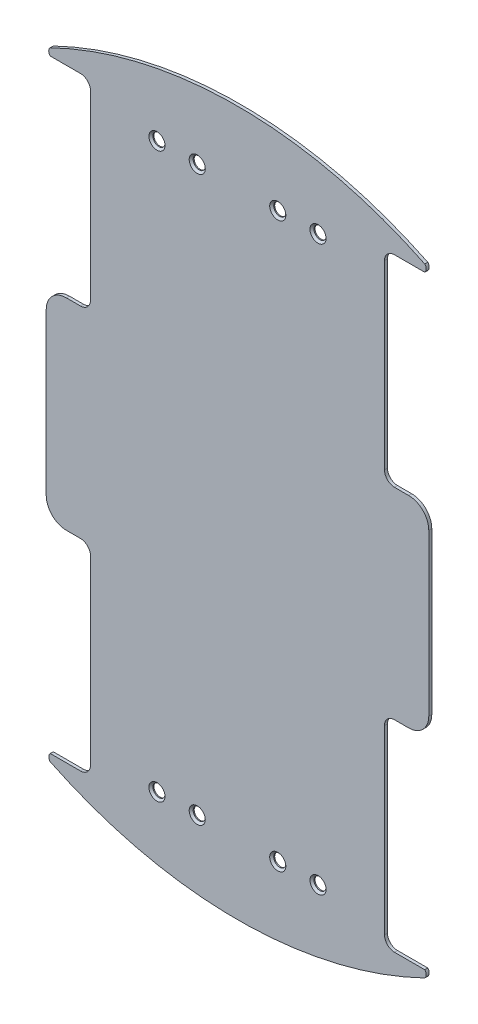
ISO-10303-21;
HEADER;
FILE_DESCRIPTION(('STEP AP214'),'2;1');
FILE_NAME('part.step','',(''),(''),'','','');
FILE_SCHEMA(('AUTOMOTIVE_DESIGN { 1 0 10303 214 1 1 1 1 }'));
ENDSEC;
DATA;
#1=APPLICATION_CONTEXT('core data for automotive mechanical design processes');
#2=APPLICATION_PROTOCOL_DEFINITION('international standard','automotive_design',2000,#1);
#3=PRODUCT_CONTEXT('',#1,'mechanical');
#4=PRODUCT('Part','Part','',(#3));
#5=PRODUCT_RELATED_PRODUCT_CATEGORY('part','',(#4));
#6=PRODUCT_DEFINITION_FORMATION('','',#4);
#7=PRODUCT_DEFINITION_CONTEXT('part definition',#1,'design');
#8=PRODUCT_DEFINITION('design','',#6,#7);
#9=PRODUCT_DEFINITION_SHAPE('','',#8);
#10=(LENGTH_UNIT() NAMED_UNIT(*) SI_UNIT(.MILLI.,.METRE.));
#11=(NAMED_UNIT(*) PLANE_ANGLE_UNIT() SI_UNIT($,.RADIAN.));
#12=(NAMED_UNIT(*) SI_UNIT($,.STERADIAN.) SOLID_ANGLE_UNIT());
#13=UNCERTAINTY_MEASURE_WITH_UNIT(LENGTH_MEASURE(1.E-05),#10,'distance_accuracy_value','');
#14=(GEOMETRIC_REPRESENTATION_CONTEXT(3) GLOBAL_UNCERTAINTY_ASSIGNED_CONTEXT((#13)) GLOBAL_UNIT_ASSIGNED_CONTEXT((#10,
#11,#12)) REPRESENTATION_CONTEXT('',''));
#15=CARTESIAN_POINT('',(0.,0.,0.));
#16=DIRECTION('',(0.,0.,1.));
#17=DIRECTION('',(1.,0.,0.));
#18=AXIS2_PLACEMENT_3D('',#15,#16,#17);
#19=CARTESIAN_POINT('',(113.,10.,1.5));
#20=DIRECTION('',(0.,0.,1.));
#21=DIRECTION('',(1.,0.,0.));
#22=AXIS2_PLACEMENT_3D('',#19,#20,#21);
#23=CONICAL_SURFACE('',#22,4.00000000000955,0.785398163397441);
#24=CARTESIAN_POINT('',(113.,10.,0.499999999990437));
#25=DIRECTION('',(0.,0.,1.));
#26=DIRECTION('',(1.,0.,0.));
#27=AXIS2_PLACEMENT_3D('',#24,#25,#26);
#28=CIRCLE('',#27,3.);
#29=CARTESIAN_POINT('',(116.,10.,0.499999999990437));
#30=VERTEX_POINT('',#29);
#31=EDGE_CURVE('E43',#30,#30,#28,.T.);
#32=ORIENTED_EDGE('',*,*,#31,.F.);
#33=EDGE_LOOP('',(#32));
#34=FACE_BOUND('',#33,.T.);
#35=CARTESIAN_POINT('',(113.,10.,1.5));
#36=DIRECTION('',(0.,0.,1.));
#37=DIRECTION('',(1.,0.,0.));
#38=AXIS2_PLACEMENT_3D('',#35,#36,#37);
#39=CIRCLE('',#38,4.00000000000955);
#40=CARTESIAN_POINT('',(117.000000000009,10.,1.5));
#41=VERTEX_POINT('',#40);
#42=EDGE_CURVE('E11',#41,#41,#39,.T.);
#43=ORIENTED_EDGE('',*,*,#42,.T.);
#44=EDGE_LOOP('',(#43));
#45=FACE_BOUND('',#44,.T.);
#46=ADVANCED_FACE('F36',(#34,#45),#23,.F.);
#47=CARTESIAN_POINT('',(113.,10.,1.5));
#48=DIRECTION('',(0.,0.,1.));
#49=DIRECTION('',(1.,0.,0.));
#50=AXIS2_PLACEMENT_3D('',#47,#48,#49);
#51=CYLINDRICAL_SURFACE('',#50,3.);
#52=CARTESIAN_POINT('',(113.,10.,0.));
#53=DIRECTION('',(0.,0.,1.));
#54=DIRECTION('',(1.,0.,0.));
#55=AXIS2_PLACEMENT_3D('',#52,#53,#54);
#56=CIRCLE('',#55,3.);
#57=CARTESIAN_POINT('',(116.,10.,0.));
#58=VERTEX_POINT('',#57);
#59=EDGE_CURVE('E481',#58,#58,#56,.T.);
#60=ORIENTED_EDGE('',*,*,#59,.F.);
#61=EDGE_LOOP('',(#60));
#62=FACE_BOUND('',#61,.T.);
#63=ORIENTED_EDGE('',*,*,#31,.T.);
#64=EDGE_LOOP('',(#63));
#65=FACE_BOUND('',#64,.T.);
#66=ADVANCED_FACE('F486',(#62,#65),#51,.F.);
#67=CARTESIAN_POINT('',(113.,290.,1.5));
#68=DIRECTION('',(0.,0.,1.));
#69=DIRECTION('',(1.,0.,0.));
#70=AXIS2_PLACEMENT_3D('',#67,#68,#69);
#71=CONICAL_SURFACE('',#70,4.00000000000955,0.785398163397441);
#72=CARTESIAN_POINT('',(113.,290.,0.499999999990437));
#73=DIRECTION('',(0.,0.,1.));
#74=DIRECTION('',(1.,0.,0.));
#75=AXIS2_PLACEMENT_3D('',#72,#73,#74);
#76=CIRCLE('',#75,3.);
#77=CARTESIAN_POINT('',(116.,290.,0.499999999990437));
#78=VERTEX_POINT('',#77);
#79=EDGE_CURVE('E475',#78,#78,#76,.T.);
#80=ORIENTED_EDGE('',*,*,#79,.F.);
#81=EDGE_LOOP('',(#80));
#82=FACE_BOUND('',#81,.T.);
#83=CARTESIAN_POINT('',(113.,290.,1.5));
#84=DIRECTION('',(0.,0.,1.));
#85=DIRECTION('',(1.,0.,0.));
#86=AXIS2_PLACEMENT_3D('',#83,#84,#85);
#87=CIRCLE('',#86,4.00000000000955);
#88=CARTESIAN_POINT('',(117.000000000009,290.,1.5));
#89=VERTEX_POINT('',#88);
#90=EDGE_CURVE('E478',#89,#89,#87,.T.);
#91=ORIENTED_EDGE('',*,*,#90,.T.);
#92=EDGE_LOOP('',(#91));
#93=FACE_BOUND('',#92,.T.);
#94=ADVANCED_FACE('F687',(#82,#93),#71,.F.);
#95=CARTESIAN_POINT('',(113.,290.,1.5));
#96=DIRECTION('',(0.,0.,1.));
#97=DIRECTION('',(1.,0.,0.));
#98=AXIS2_PLACEMENT_3D('',#95,#96,#97);
#99=CYLINDRICAL_SURFACE('',#98,3.);
#100=CARTESIAN_POINT('',(113.,290.,0.));
#101=DIRECTION('',(0.,0.,1.));
#102=DIRECTION('',(1.,0.,0.));
#103=AXIS2_PLACEMENT_3D('',#100,#101,#102);
#104=CIRCLE('',#103,3.);
#105=CARTESIAN_POINT('',(116.,290.,0.));
#106=VERTEX_POINT('',#105);
#107=EDGE_CURVE('E472',#106,#106,#104,.T.);
#108=ORIENTED_EDGE('',*,*,#107,.F.);
#109=EDGE_LOOP('',(#108));
#110=FACE_BOUND('',#109,.T.);
#111=ORIENTED_EDGE('',*,*,#79,.T.);
#112=EDGE_LOOP('',(#111));
#113=FACE_BOUND('',#112,.T.);
#114=ADVANCED_FACE('F683',(#110,#113),#99,.F.);
#115=CARTESIAN_POINT('',(72.9999999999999,10.,1.5));
#116=DIRECTION('',(0.,0.,1.));
#117=DIRECTION('',(1.,0.,0.));
#118=AXIS2_PLACEMENT_3D('',#115,#116,#117);
#119=CYLINDRICAL_SURFACE('',#118,2.99999999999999);
#120=CARTESIAN_POINT('',(72.9999999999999,10.,0.));
#121=DIRECTION('',(0.,0.,1.));
#122=DIRECTION('',(1.,0.,0.));
#123=AXIS2_PLACEMENT_3D('',#120,#121,#122);
#124=CIRCLE('',#123,2.99999999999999);
#125=CARTESIAN_POINT('',(75.9999999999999,10.,0.));
#126=VERTEX_POINT('',#125);
#127=EDGE_CURVE('E469',#126,#126,#124,.T.);
#128=ORIENTED_EDGE('',*,*,#127,.F.);
#129=EDGE_LOOP('',(#128));
#130=FACE_BOUND('',#129,.T.);
#131=CARTESIAN_POINT('',(72.9999999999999,10.,0.499999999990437));
#132=DIRECTION('',(0.,0.,1.));
#133=DIRECTION('',(1.,0.,0.));
#134=AXIS2_PLACEMENT_3D('',#131,#132,#133);
#135=CIRCLE('',#134,2.99999999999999);
#136=CARTESIAN_POINT('',(75.9999999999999,10.,0.499999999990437));
#137=VERTEX_POINT('',#136);
#138=EDGE_CURVE('E463',#137,#137,#135,.T.);
#139=ORIENTED_EDGE('',*,*,#138,.T.);
#140=EDGE_LOOP('',(#139));
#141=FACE_BOUND('',#140,.T.);
#142=ADVANCED_FACE('F679',(#130,#141),#119,.F.);
#143=CARTESIAN_POINT('',(72.9999999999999,10.,1.5));
#144=DIRECTION('',(0.,0.,1.));
#145=DIRECTION('',(1.,0.,0.));
#146=AXIS2_PLACEMENT_3D('',#143,#144,#145);
#147=CONICAL_SURFACE('',#146,4.00000000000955,0.785398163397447);
#148=ORIENTED_EDGE('',*,*,#138,.F.);
#149=EDGE_LOOP('',(#148));
#150=FACE_BOUND('',#149,.T.);
#151=CARTESIAN_POINT('',(72.9999999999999,10.,1.5));
#152=DIRECTION('',(0.,0.,1.));
#153=DIRECTION('',(1.,0.,0.));
#154=AXIS2_PLACEMENT_3D('',#151,#152,#153);
#155=CIRCLE('',#154,4.00000000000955);
#156=CARTESIAN_POINT('',(77.0000000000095,10.,1.5));
#157=VERTEX_POINT('',#156);
#158=EDGE_CURVE('E466',#157,#157,#155,.T.);
#159=ORIENTED_EDGE('',*,*,#158,.T.);
#160=EDGE_LOOP('',(#159));
#161=FACE_BOUND('',#160,.T.);
#162=ADVANCED_FACE('F675',(#150,#161),#147,.F.);
#163=CARTESIAN_POINT('',(72.9999999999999,290.,1.5));
#164=DIRECTION('',(0.,0.,1.));
#165=DIRECTION('',(1.,0.,0.));
#166=AXIS2_PLACEMENT_3D('',#163,#164,#165);
#167=CONICAL_SURFACE('',#166,4.00000000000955,0.785398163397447);
#168=CARTESIAN_POINT('',(72.9999999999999,290.,0.499999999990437));
#169=DIRECTION('',(0.,0.,1.));
#170=DIRECTION('',(1.,0.,0.));
#171=AXIS2_PLACEMENT_3D('',#168,#169,#170);
#172=CIRCLE('',#171,2.99999999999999);
#173=CARTESIAN_POINT('',(75.9999999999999,290.,0.499999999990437));
#174=VERTEX_POINT('',#173);
#175=EDGE_CURVE('E457',#174,#174,#172,.T.);
#176=ORIENTED_EDGE('',*,*,#175,.F.);
#177=EDGE_LOOP('',(#176));
#178=FACE_BOUND('',#177,.T.);
#179=CARTESIAN_POINT('',(72.9999999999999,290.,1.5));
#180=DIRECTION('',(0.,0.,1.));
#181=DIRECTION('',(1.,0.,0.));
#182=AXIS2_PLACEMENT_3D('',#179,#180,#181);
#183=CIRCLE('',#182,4.00000000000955);
#184=CARTESIAN_POINT('',(77.0000000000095,290.,1.5));
#185=VERTEX_POINT('',#184);
#186=EDGE_CURVE('E460',#185,#185,#183,.T.);
#187=ORIENTED_EDGE('',*,*,#186,.T.);
#188=EDGE_LOOP('',(#187));
#189=FACE_BOUND('',#188,.T.);
#190=ADVANCED_FACE('F671',(#178,#189),#167,.F.);
#191=CARTESIAN_POINT('',(72.9999999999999,290.,1.5));
#192=DIRECTION('',(0.,0.,1.));
#193=DIRECTION('',(1.,0.,0.));
#194=AXIS2_PLACEMENT_3D('',#191,#192,#193);
#195=CYLINDRICAL_SURFACE('',#194,2.99999999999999);
#196=CARTESIAN_POINT('',(72.9999999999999,290.,0.));
#197=DIRECTION('',(0.,0.,1.));
#198=DIRECTION('',(1.,0.,0.));
#199=AXIS2_PLACEMENT_3D('',#196,#197,#198);
#200=CIRCLE('',#199,2.99999999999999);
#201=CARTESIAN_POINT('',(75.9999999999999,290.,0.));
#202=VERTEX_POINT('',#201);
#203=EDGE_CURVE('E454',#202,#202,#200,.T.);
#204=ORIENTED_EDGE('',*,*,#203,.F.);
#205=EDGE_LOOP('',(#204));
#206=FACE_BOUND('',#205,.T.);
#207=ORIENTED_EDGE('',*,*,#175,.T.);
#208=EDGE_LOOP('',(#207));
#209=FACE_BOUND('',#208,.T.);
#210=ADVANCED_FACE('F668',(#206,#209),#195,.F.);
#211=CARTESIAN_POINT('',(166.,0.,0.));
#212=DIRECTION('',(1.,0.,0.));
#213=DIRECTION('',(0.,1.,0.));
#214=AXIS2_PLACEMENT_3D('',#211,#212,#213);
#215=PLANE('',#214);
#216=DIRECTION('',(0.,1.,0.));
#217=VECTOR('',#216,1.);
#218=CARTESIAN_POINT('',(166.,0.,1.5));
#219=LINE('',#218,#217);
#220=CARTESIAN_POINT('',(166.,205.,1.5));
#221=VERTEX_POINT('',#220);
#222=CARTESIAN_POINT('',(166.,295.,1.5));
#223=VERTEX_POINT('',#222);
#224=EDGE_CURVE('E315',#221,#223,#219,.T.);
#225=ORIENTED_EDGE('',*,*,#224,.F.);
#226=DIRECTION('',(0.,0.,1.));
#227=VECTOR('',#226,1.);
#228=CARTESIAN_POINT('',(166.,205.,0.));
#229=LINE('',#228,#227);
#230=CARTESIAN_POINT('',(166.,205.,0.));
#231=VERTEX_POINT('',#230);
#232=EDGE_CURVE('E351',#221,#231,#229,.F.);
#233=ORIENTED_EDGE('',*,*,#232,.T.);
#234=DIRECTION('',(0.,1.,0.));
#235=VECTOR('',#234,1.);
#236=CARTESIAN_POINT('',(166.,0.,0.));
#237=LINE('',#236,#235);
#238=CARTESIAN_POINT('',(166.,295.,0.));
#239=VERTEX_POINT('',#238);
#240=EDGE_CURVE('E281',#231,#239,#237,.T.);
#241=ORIENTED_EDGE('',*,*,#240,.T.);
#242=DIRECTION('',(0.,0.,1.));
#243=VECTOR('',#242,1.);
#244=CARTESIAN_POINT('',(166.,295.,1.5));
#245=LINE('',#244,#243);
#246=EDGE_CURVE('E348',#239,#223,#245,.T.);
#247=ORIENTED_EDGE('',*,*,#246,.T.);
#248=EDGE_LOOP('',(#225,#233,#241,#247));
#249=FACE_BOUND('',#248,.T.);
#250=ADVANCED_FACE('F644',(#249),#215,.T.);
#251=CARTESIAN_POINT('',(166.,4.99999999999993,1.5));
#252=VERTEX_POINT('',#251);
#253=CARTESIAN_POINT('',(166.,94.9999999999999,1.5));
#254=VERTEX_POINT('',#253);
#255=EDGE_CURVE('E316',#252,#254,#219,.T.);
#256=ORIENTED_EDGE('',*,*,#255,.F.);
#257=DIRECTION('',(0.,0.,1.));
#258=VECTOR('',#257,1.);
#259=CARTESIAN_POINT('',(166.,4.99999999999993,0.));
#260=LINE('',#259,#258);
#261=CARTESIAN_POINT('',(166.,4.99999999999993,0.));
#262=VERTEX_POINT('',#261);
#263=EDGE_CURVE('E368',#252,#262,#260,.F.);
#264=ORIENTED_EDGE('',*,*,#263,.T.);
#265=CARTESIAN_POINT('',(166.,94.9999999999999,0.));
#266=VERTEX_POINT('',#265);
#267=EDGE_CURVE('E282',#262,#266,#237,.T.);
#268=ORIENTED_EDGE('',*,*,#267,.T.);
#269=DIRECTION('',(0.,0.,-1.));
#270=VECTOR('',#269,1.);
#271=CARTESIAN_POINT('',(166.,94.9999999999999,-8.79143401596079E-13));
#272=LINE('',#271,#270);
#273=EDGE_CURVE('E366',#266,#254,#272,.F.);
#274=ORIENTED_EDGE('',*,*,#273,.T.);
#275=EDGE_LOOP('',(#256,#264,#268,#274));
#276=FACE_BOUND('',#275,.T.);
#277=ADVANCED_FACE('F803',(#276),#215,.T.);
#278=CARTESIAN_POINT('',(20.,300.,0.));
#279=DIRECTION('',(-1.,0.,0.));
#280=DIRECTION('',(0.,-1.,0.));
#281=AXIS2_PLACEMENT_3D('',#278,#279,#280);
#282=PLANE('',#281);
#283=DIRECTION('',(0.,-1.,0.));
#284=VECTOR('',#283,1.);
#285=CARTESIAN_POINT('',(20.,300.,1.5));
#286=LINE('',#285,#284);
#287=CARTESIAN_POINT('',(20.,95.,1.5));
#288=VERTEX_POINT('',#287);
#289=CARTESIAN_POINT('',(20.,5.00000000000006,1.5));
#290=VERTEX_POINT('',#289);
#291=EDGE_CURVE('E298',#288,#290,#286,.T.);
#292=ORIENTED_EDGE('',*,*,#291,.F.);
#293=DIRECTION('',(0.,0.,1.));
#294=VECTOR('',#293,1.);
#295=CARTESIAN_POINT('',(20.,95.,0.));
#296=LINE('',#295,#294);
#297=CARTESIAN_POINT('',(20.,95.,0.));
#298=VERTEX_POINT('',#297);
#299=EDGE_CURVE('E361',#288,#298,#296,.F.);
#300=ORIENTED_EDGE('',*,*,#299,.T.);
#301=DIRECTION('',(0.,-1.,0.));
#302=VECTOR('',#301,1.);
#303=CARTESIAN_POINT('',(20.,300.,0.));
#304=LINE('',#303,#302);
#305=CARTESIAN_POINT('',(20.,5.00000000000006,0.));
#306=VERTEX_POINT('',#305);
#307=EDGE_CURVE('E564',#298,#306,#304,.T.);
#308=ORIENTED_EDGE('',*,*,#307,.T.);
#309=DIRECTION('',(0.,0.,1.));
#310=VECTOR('',#309,1.);
#311=CARTESIAN_POINT('',(20.,5.00000000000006,1.5));
#312=LINE('',#311,#310);
#313=EDGE_CURVE('E358',#306,#290,#312,.T.);
#314=ORIENTED_EDGE('',*,*,#313,.T.);
#315=EDGE_LOOP('',(#292,#300,#308,#314));
#316=FACE_BOUND('',#315,.T.);
#317=ADVANCED_FACE('F574',(#316),#282,.T.);
#318=CARTESIAN_POINT('',(20.,295.,0.));
#319=VERTEX_POINT('',#318);
#320=CARTESIAN_POINT('',(20.,205.,0.));
#321=VERTEX_POINT('',#320);
#322=EDGE_CURVE('E255',#319,#321,#304,.T.);
#323=ORIENTED_EDGE('',*,*,#322,.T.);
#324=DIRECTION('',(0.,0.,-1.));
#325=VECTOR('',#324,1.);
#326=CARTESIAN_POINT('',(20.,205.,0.));
#327=LINE('',#326,#325);
#328=CARTESIAN_POINT('',(20.,205.,1.5));
#329=VERTEX_POINT('',#328);
#330=EDGE_CURVE('E378',#321,#329,#327,.F.);
#331=ORIENTED_EDGE('',*,*,#330,.T.);
#332=CARTESIAN_POINT('',(20.,295.,1.5));
#333=VERTEX_POINT('',#332);
#334=EDGE_CURVE('E300',#333,#329,#286,.T.);
#335=ORIENTED_EDGE('',*,*,#334,.F.);
#336=DIRECTION('',(0.,0.,1.));
#337=VECTOR('',#336,1.);
#338=CARTESIAN_POINT('',(20.,295.,0.));
#339=LINE('',#338,#337);
#340=EDGE_CURVE('E376',#333,#319,#339,.F.);
#341=ORIENTED_EDGE('',*,*,#340,.T.);
#342=EDGE_LOOP('',(#323,#331,#335,#341));
#343=FACE_BOUND('',#342,.T.);
#344=ADVANCED_FACE('F821',(#343),#282,.T.);
#345=CARTESIAN_POINT('',(0.,300.,0.));
#346=DIRECTION('',(0.,-1.,0.));
#347=DIRECTION('',(0.,0.,-1.));
#348=AXIS2_PLACEMENT_3D('',#345,#346,#347);
#349=PLANE('',#348);
#350=DIRECTION('',(1.,0.,0.));
#351=VECTOR('',#350,1.);
#352=CARTESIAN_POINT('',(0.,300.,0.));
#353=LINE('',#352,#351);
#354=CARTESIAN_POINT('',(0.,300.,0.));
#355=VERTEX_POINT('',#354);
#356=CARTESIAN_POINT('',(15.,300.,0.));
#357=VERTEX_POINT('',#356);
#358=EDGE_CURVE('E330',#355,#357,#353,.T.);
#359=ORIENTED_EDGE('',*,*,#358,.T.);
#360=DIRECTION('',(0.,0.,1.));
#361=VECTOR('',#360,1.);
#362=CARTESIAN_POINT('',(15.,300.,1.5));
#363=LINE('',#362,#361);
#364=CARTESIAN_POINT('',(15.,300.,1.5));
#365=VERTEX_POINT('',#364);
#366=EDGE_CURVE('E381',#357,#365,#363,.T.);
#367=ORIENTED_EDGE('',*,*,#366,.T.);
#368=DIRECTION('',(1.,0.,0.));
#369=VECTOR('',#368,1.);
#370=CARTESIAN_POINT('',(0.,300.,1.5));
#371=LINE('',#370,#369);
#372=CARTESIAN_POINT('',(0.,300.,1.5));
#373=VERTEX_POINT('',#372);
#374=EDGE_CURVE('E295',#373,#365,#371,.T.);
#375=ORIENTED_EDGE('',*,*,#374,.F.);
#376=DIRECTION('',(0.,0.,1.));
#377=VECTOR('',#376,1.);
#378=CARTESIAN_POINT('',(0.,300.,0.));
#379=LINE('',#378,#377);
#380=EDGE_CURVE('E331',#355,#373,#379,.T.);
#381=ORIENTED_EDGE('',*,*,#380,.F.);
#382=EDGE_LOOP('',(#359,#367,#375,#381));
#383=FACE_BOUND('',#382,.T.);
#384=ADVANCED_FACE('F616',(#383),#349,.T.);
#385=CARTESIAN_POINT('',(1.75878232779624,301.791166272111,0.));
#386=DIRECTION('',(0.,0.,1.));
#387=DIRECTION('',(1.,0.,0.));
#388=AXIS2_PLACEMENT_3D('',#385,#386,#387);
#389=CYLINDRICAL_SURFACE('',#388,2.51029717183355);
#390=CARTESIAN_POINT('',(1.75878232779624,301.791166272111,1.5));
#391=DIRECTION('',(0.,0.,1.));
#392=DIRECTION('',(1.,0.,0.));
#393=AXIS2_PLACEMENT_3D('',#390,#391,#392);
#394=CIRCLE('',#393,2.51029717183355);
#395=CARTESIAN_POINT('',(-0.0322588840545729,303.550075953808,1.5));
#396=VERTEX_POINT('',#395);
#397=EDGE_CURVE('E327',#396,#373,#394,.T.);
#398=ORIENTED_EDGE('',*,*,#397,.F.);
#399=DIRECTION('',(0.,0.,1.));
#400=VECTOR('',#399,1.);
#401=CARTESIAN_POINT('',(-0.0322588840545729,303.550075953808,0.));
#402=LINE('',#401,#400);
#403=CARTESIAN_POINT('',(-0.0322588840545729,303.550075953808,0.));
#404=VERTEX_POINT('',#403);
#405=EDGE_CURVE('E334',#404,#396,#402,.T.);
#406=ORIENTED_EDGE('',*,*,#405,.F.);
#407=CARTESIAN_POINT('',(1.75878232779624,301.791166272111,0.));
#408=DIRECTION('',(0.,0.,1.));
#409=DIRECTION('',(1.,0.,0.));
#410=AXIS2_PLACEMENT_3D('',#407,#408,#409);
#411=CIRCLE('',#410,2.51029717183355);
#412=EDGE_CURVE('E263',#404,#355,#411,.T.);
#413=ORIENTED_EDGE('',*,*,#412,.T.);
#414=ORIENTED_EDGE('',*,*,#380,.T.);
#415=EDGE_LOOP('',(#398,#406,#413,#414));
#416=FACE_BOUND('',#415,.T.);
#417=ADVANCED_FACE('F621',(#416),#389,.T.);
#418=CARTESIAN_POINT('',(93.0060075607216,112.50000142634,0.));
#419=DIRECTION('',(0.,0.,1.));
#420=DIRECTION('',(1.,0.,0.));
#421=AXIS2_PLACEMENT_3D('',#418,#419,#420);
#422=CYLINDRICAL_SURFACE('',#421,212.5);
#423=CARTESIAN_POINT('',(93.0060075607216,112.50000142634,1.5));
#424=DIRECTION('',(0.,0.,1.));
#425=DIRECTION('',(1.,0.,0.));
#426=AXIS2_PLACEMENT_3D('',#423,#424,#425);
#427=CIRCLE('',#426,212.5);
#428=CARTESIAN_POINT('',(186.,303.571630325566,1.5));
#429=VERTEX_POINT('',#428);
#430=EDGE_CURVE('E324',#429,#396,#427,.T.);
#431=ORIENTED_EDGE('',*,*,#430,.F.);
#432=DIRECTION('',(0.,0.,1.));
#433=VECTOR('',#432,1.);
#434=CARTESIAN_POINT('',(186.,303.571630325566,0.));
#435=LINE('',#434,#433);
#436=CARTESIAN_POINT('',(186.,303.571630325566,0.));
#437=VERTEX_POINT('',#436);
#438=EDGE_CURVE('E336',#437,#429,#435,.T.);
#439=ORIENTED_EDGE('',*,*,#438,.F.);
#440=CARTESIAN_POINT('',(93.0060075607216,112.50000142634,0.));
#441=DIRECTION('',(0.,0.,1.));
#442=DIRECTION('',(1.,0.,0.));
#443=AXIS2_PLACEMENT_3D('',#440,#441,#442);
#444=CIRCLE('',#443,212.5);
#445=EDGE_CURVE('E290',#437,#404,#444,.T.);
#446=ORIENTED_EDGE('',*,*,#445,.T.);
#447=ORIENTED_EDGE('',*,*,#405,.T.);
#448=EDGE_LOOP('',(#431,#439,#446,#447));
#449=FACE_BOUND('',#448,.T.);
#450=ADVANCED_FACE('F793',(#449),#422,.T.);
#451=CARTESIAN_POINT('',(184.214184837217,301.785815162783,0.));
#452=DIRECTION('',(0.,0.,1.));
#453=DIRECTION('',(1.,0.,0.));
#454=AXIS2_PLACEMENT_3D('',#451,#452,#453);
#455=CYLINDRICAL_SURFACE('',#454,2.52552402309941);
#456=CARTESIAN_POINT('',(184.214184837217,301.785815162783,1.5));
#457=DIRECTION('',(0.,0.,1.));
#458=DIRECTION('',(1.,0.,0.));
#459=AXIS2_PLACEMENT_3D('',#456,#457,#458);
#460=CIRCLE('',#459,2.52552402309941);
#461=CARTESIAN_POINT('',(186.,300.,1.5));
#462=VERTEX_POINT('',#461);
#463=EDGE_CURVE('E321',#462,#429,#460,.T.);
#464=ORIENTED_EDGE('',*,*,#463,.F.);
#465=DIRECTION('',(0.,0.,1.));
#466=VECTOR('',#465,1.);
#467=CARTESIAN_POINT('',(186.,300.,0.));
#468=LINE('',#467,#466);
#469=CARTESIAN_POINT('',(186.,300.,0.));
#470=VERTEX_POINT('',#469);
#471=EDGE_CURVE('E338',#470,#462,#468,.T.);
#472=ORIENTED_EDGE('',*,*,#471,.F.);
#473=CARTESIAN_POINT('',(184.214184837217,301.785815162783,0.));
#474=DIRECTION('',(0.,0.,1.));
#475=DIRECTION('',(1.,0.,0.));
#476=AXIS2_PLACEMENT_3D('',#473,#474,#475);
#477=CIRCLE('',#476,2.52552402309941);
#478=EDGE_CURVE('E287',#470,#437,#477,.T.);
#479=ORIENTED_EDGE('',*,*,#478,.T.);
#480=ORIENTED_EDGE('',*,*,#438,.T.);
#481=EDGE_LOOP('',(#464,#472,#479,#480));
#482=FACE_BOUND('',#481,.T.);
#483=ADVANCED_FACE('F630',(#482),#455,.T.);
#484=CARTESIAN_POINT('',(166.,300.,0.));
#485=DIRECTION('',(0.,-1.,0.));
#486=DIRECTION('',(1.,0.,0.));
#487=AXIS2_PLACEMENT_3D('',#484,#485,#486);
#488=PLANE('',#487);
#489=DIRECTION('',(1.,0.,0.));
#490=VECTOR('',#489,1.);
#491=CARTESIAN_POINT('',(166.,300.,1.5));
#492=LINE('',#491,#490);
#493=CARTESIAN_POINT('',(171.,300.,1.5));
#494=VERTEX_POINT('',#493);
#495=EDGE_CURVE('E319',#494,#462,#492,.T.);
#496=ORIENTED_EDGE('',*,*,#495,.F.);
#497=DIRECTION('',(0.,0.,1.));
#498=VECTOR('',#497,1.);
#499=CARTESIAN_POINT('',(171.,300.,0.));
#500=LINE('',#499,#498);
#501=CARTESIAN_POINT('',(171.,300.,0.));
#502=VERTEX_POINT('',#501);
#503=EDGE_CURVE('E353',#494,#502,#500,.F.);
#504=ORIENTED_EDGE('',*,*,#503,.T.);
#505=DIRECTION('',(1.,0.,0.));
#506=VECTOR('',#505,1.);
#507=CARTESIAN_POINT('',(166.,300.,0.));
#508=LINE('',#507,#506);
#509=EDGE_CURVE('E285',#502,#470,#508,.T.);
#510=ORIENTED_EDGE('',*,*,#509,.T.);
#511=ORIENTED_EDGE('',*,*,#471,.T.);
#512=EDGE_LOOP('',(#496,#504,#510,#511));
#513=FACE_BOUND('',#512,.T.);
#514=ADVANCED_FACE('F633',(#513),#488,.T.);
#515=CARTESIAN_POINT('',(186.,0.,0.));
#516=DIRECTION('',(0.,1.,0.));
#517=DIRECTION('',(0.,0.,1.));
#518=AXIS2_PLACEMENT_3D('',#515,#516,#517);
#519=PLANE('',#518);
#520=DIRECTION('',(-1.,0.,0.));
#521=VECTOR('',#520,1.);
#522=CARTESIAN_POINT('',(186.,0.,0.));
#523=LINE('',#522,#521);
#524=CARTESIAN_POINT('',(186.,0.,0.));
#525=VERTEX_POINT('',#524);
#526=CARTESIAN_POINT('',(171.,0.,0.));
#527=VERTEX_POINT('',#526);
#528=EDGE_CURVE('E278',#525,#527,#523,.T.);
#529=ORIENTED_EDGE('',*,*,#528,.T.);
#530=DIRECTION('',(0.,0.,1.));
#531=VECTOR('',#530,1.);
#532=CARTESIAN_POINT('',(171.,0.,1.5));
#533=LINE('',#532,#531);
#534=CARTESIAN_POINT('',(171.,0.,1.5));
#535=VERTEX_POINT('',#534);
#536=EDGE_CURVE('E363',#527,#535,#533,.T.);
#537=ORIENTED_EDGE('',*,*,#536,.T.);
#538=DIRECTION('',(-1.,0.,0.));
#539=VECTOR('',#538,1.);
#540=CARTESIAN_POINT('',(186.,0.,1.5));
#541=LINE('',#540,#539);
#542=CARTESIAN_POINT('',(186.,0.,1.5));
#543=VERTEX_POINT('',#542);
#544=EDGE_CURVE('E312',#543,#535,#541,.T.);
#545=ORIENTED_EDGE('',*,*,#544,.F.);
#546=DIRECTION('',(0.,0.,1.));
#547=VECTOR('',#546,1.);
#548=CARTESIAN_POINT('',(186.,0.,0.));
#549=LINE('',#548,#547);
#550=EDGE_CURVE('E341',#525,#543,#549,.T.);
#551=ORIENTED_EDGE('',*,*,#550,.F.);
#552=EDGE_LOOP('',(#529,#537,#545,#551));
#553=FACE_BOUND('',#552,.T.);
#554=ADVANCED_FACE('F800',(#553),#519,.T.);
#555=CARTESIAN_POINT('',(184.215647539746,-1.78435246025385,0.));
#556=DIRECTION('',(0.,0.,1.));
#557=DIRECTION('',(1.,0.,0.));
#558=AXIS2_PLACEMENT_3D('',#555,#556,#557);
#559=CYLINDRICAL_SURFACE('',#558,2.52345544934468);
#560=CARTESIAN_POINT('',(184.215647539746,-1.78435246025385,1.5));
#561=DIRECTION('',(0.,0.,1.));
#562=DIRECTION('',(1.,0.,0.));
#563=AXIS2_PLACEMENT_3D('',#560,#561,#562);
#564=CIRCLE('',#563,2.52345544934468);
#565=CARTESIAN_POINT('',(186.,-3.56870492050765,1.5));
#566=VERTEX_POINT('',#565);
#567=EDGE_CURVE('E309',#566,#543,#564,.T.);
#568=ORIENTED_EDGE('',*,*,#567,.F.);
#569=DIRECTION('',(0.,0.,1.));
#570=VECTOR('',#569,1.);
#571=CARTESIAN_POINT('',(186.,-3.56870492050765,0.));
#572=LINE('',#571,#570);
#573=CARTESIAN_POINT('',(186.,-3.56870492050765,0.));
#574=VERTEX_POINT('',#573);
#575=EDGE_CURVE('E343',#574,#566,#572,.T.);
#576=ORIENTED_EDGE('',*,*,#575,.F.);
#577=CARTESIAN_POINT('',(184.215647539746,-1.78435246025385,0.));
#578=DIRECTION('',(0.,0.,1.));
#579=DIRECTION('',(1.,0.,0.));
#580=AXIS2_PLACEMENT_3D('',#577,#578,#579);
#581=CIRCLE('',#580,2.52345544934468);
#582=EDGE_CURVE('E272',#574,#525,#581,.T.);
#583=ORIENTED_EDGE('',*,*,#582,.T.);
#584=ORIENTED_EDGE('',*,*,#550,.T.);
#585=EDGE_LOOP('',(#568,#576,#583,#584));
#586=FACE_BOUND('',#585,.T.);
#587=ADVANCED_FACE('F806',(#586),#559,.T.);
#588=CARTESIAN_POINT('',(93.,187.5,0.));
#589=DIRECTION('',(0.,0.,1.));
#590=DIRECTION('',(1.,0.,0.));
#591=AXIS2_PLACEMENT_3D('',#588,#589,#590);
#592=CYLINDRICAL_SURFACE('',#591,212.5);
#593=CARTESIAN_POINT('',(93.,187.5,1.5));
#594=DIRECTION('',(0.,0.,1.));
#595=DIRECTION('',(1.,0.,0.));
#596=AXIS2_PLACEMENT_3D('',#593,#594,#595);
#597=CIRCLE('',#596,212.5);
#598=CARTESIAN_POINT('',(0.,-3.56870492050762,1.5));
#599=VERTEX_POINT('',#598);
#600=EDGE_CURVE('E306',#599,#566,#597,.T.);
#601=ORIENTED_EDGE('',*,*,#600,.F.);
#602=DIRECTION('',(0.,0.,1.));
#603=VECTOR('',#602,1.);
#604=CARTESIAN_POINT('',(0.,-3.56870492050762,0.));
#605=LINE('',#604,#603);
#606=CARTESIAN_POINT('',(0.,-3.56870492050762,0.));
#607=VERTEX_POINT('',#606);
#608=EDGE_CURVE('E262',#607,#599,#605,.T.);
#609=ORIENTED_EDGE('',*,*,#608,.F.);
#610=CARTESIAN_POINT('',(93.,187.5,0.));
#611=DIRECTION('',(0.,0.,1.));
#612=DIRECTION('',(1.,0.,0.));
#613=AXIS2_PLACEMENT_3D('',#610,#611,#612);
#614=CIRCLE('',#613,212.5);
#615=EDGE_CURVE('E270',#607,#574,#614,.T.);
#616=ORIENTED_EDGE('',*,*,#615,.T.);
#617=ORIENTED_EDGE('',*,*,#575,.T.);
#618=EDGE_LOOP('',(#601,#609,#616,#617));
#619=FACE_BOUND('',#618,.T.);
#620=ADVANCED_FACE('F810',(#619),#592,.T.);
#621=CARTESIAN_POINT('',(1.7843524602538,-1.7843524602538,0.));
#622=DIRECTION('',(0.,0.,1.));
#623=DIRECTION('',(1.,0.,0.));
#624=AXIS2_PLACEMENT_3D('',#621,#622,#623);
#625=CYLINDRICAL_SURFACE('',#624,2.52345544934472);
#626=CARTESIAN_POINT('',(1.7843524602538,-1.7843524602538,1.5));
#627=DIRECTION('',(0.,0.,1.));
#628=DIRECTION('',(1.,0.,0.));
#629=AXIS2_PLACEMENT_3D('',#626,#627,#628);
#630=CIRCLE('',#629,2.52345544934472);
#631=CARTESIAN_POINT('',(0.,0.,1.5));
#632=VERTEX_POINT('',#631);
#633=EDGE_CURVE('E261',#632,#599,#630,.T.);
#634=ORIENTED_EDGE('',*,*,#633,.F.);
#635=DIRECTION('',(0.,0.,1.));
#636=VECTOR('',#635,1.);
#637=CARTESIAN_POINT('',(0.,0.,0.));
#638=LINE('',#637,#636);
#639=CARTESIAN_POINT('',(0.,0.,0.));
#640=VERTEX_POINT('',#639);
#641=EDGE_CURVE('E247',#640,#632,#638,.T.);
#642=ORIENTED_EDGE('',*,*,#641,.F.);
#643=CARTESIAN_POINT('',(1.7843524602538,-1.7843524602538,0.));
#644=DIRECTION('',(0.,0.,1.));
#645=DIRECTION('',(1.,0.,0.));
#646=AXIS2_PLACEMENT_3D('',#643,#644,#645);
#647=CIRCLE('',#646,2.52345544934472);
#648=EDGE_CURVE('E254',#640,#607,#647,.T.);
#649=ORIENTED_EDGE('',*,*,#648,.T.);
#650=ORIENTED_EDGE('',*,*,#608,.T.);
#651=EDGE_LOOP('',(#634,#642,#649,#650));
#652=FACE_BOUND('',#651,.T.);
#653=ADVANCED_FACE('F259',(#652),#625,.T.);
#654=CARTESIAN_POINT('',(20.,0.,0.));
#655=DIRECTION('',(0.,1.,0.));
#656=DIRECTION('',(0.,0.,1.));
#657=AXIS2_PLACEMENT_3D('',#654,#655,#656);
#658=PLANE('',#657);
#659=DIRECTION('',(-1.,0.,0.));
#660=VECTOR('',#659,1.);
#661=CARTESIAN_POINT('',(20.,0.,1.5));
#662=LINE('',#661,#660);
#663=CARTESIAN_POINT('',(15.,0.,1.5));
#664=VERTEX_POINT('',#663);
#665=EDGE_CURVE('E303',#664,#632,#662,.T.);
#666=ORIENTED_EDGE('',*,*,#665,.F.);
#667=DIRECTION('',(0.,0.,1.));
#668=VECTOR('',#667,1.);
#669=CARTESIAN_POINT('',(15.,0.,0.));
#670=LINE('',#669,#668);
#671=CARTESIAN_POINT('',(15.,0.,0.));
#672=VERTEX_POINT('',#671);
#673=EDGE_CURVE('E250',#664,#672,#670,.F.);
#674=ORIENTED_EDGE('',*,*,#673,.T.);
#675=DIRECTION('',(-1.,0.,0.));
#676=VECTOR('',#675,1.);
#677=CARTESIAN_POINT('',(20.,0.,0.));
#678=LINE('',#677,#676);
#679=EDGE_CURVE('E243',#672,#640,#678,.T.);
#680=ORIENTED_EDGE('',*,*,#679,.T.);
#681=ORIENTED_EDGE('',*,*,#641,.T.);
#682=EDGE_LOOP('',(#666,#674,#680,#681));
#683=FACE_BOUND('',#682,.T.);
#684=ADVANCED_FACE('F246',(#683),#658,.T.);
#685=CARTESIAN_POINT('',(1.7843524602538,-1.7843524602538,0.));
#686=DIRECTION('',(0.,0.,1.));
#687=DIRECTION('',(1.,0.,0.));
#688=AXIS2_PLACEMENT_3D('',#685,#686,#687);
#689=PLANE('',#688);
#690=ORIENTED_EDGE('',*,*,#59,.T.);
#691=EDGE_LOOP('',(#690));
#692=FACE_BOUND('',#691,.T.);
#693=ORIENTED_EDGE('',*,*,#107,.T.);
#694=EDGE_LOOP('',(#693));
#695=FACE_BOUND('',#694,.T.);
#696=ORIENTED_EDGE('',*,*,#203,.T.);
#697=EDGE_LOOP('',(#696));
#698=FACE_BOUND('',#697,.T.);
#699=ORIENTED_EDGE('',*,*,#127,.T.);
#700=EDGE_LOOP('',(#699));
#701=FACE_BOUND('',#700,.T.);
#702=CARTESIAN_POINT('',(133.,290.,0.));
#703=DIRECTION('',(0.,0.,1.));
#704=DIRECTION('',(1.,0.,0.));
#705=AXIS2_PLACEMENT_3D('',#702,#703,#704);
#706=CIRCLE('',#705,3.);
#707=CARTESIAN_POINT('',(136.,290.,0.));
#708=VERTEX_POINT('',#707);
#709=EDGE_CURVE('E709',#708,#708,#706,.T.);
#710=ORIENTED_EDGE('',*,*,#709,.T.);
#711=EDGE_LOOP('',(#710));
#712=FACE_BOUND('',#711,.T.);
#713=CARTESIAN_POINT('',(52.9999999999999,10.,0.));
#714=DIRECTION('',(0.,0.,1.));
#715=DIRECTION('',(1.,0.,0.));
#716=AXIS2_PLACEMENT_3D('',#713,#714,#715);
#717=CIRCLE('',#716,2.99999999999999);
#718=CARTESIAN_POINT('',(55.9999999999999,10.,0.));
#719=VERTEX_POINT('',#718);
#720=EDGE_CURVE('E713',#719,#719,#717,.T.);
#721=ORIENTED_EDGE('',*,*,#720,.T.);
#722=EDGE_LOOP('',(#721));
#723=FACE_BOUND('',#722,.T.);
#724=CARTESIAN_POINT('',(133.,10.,0.));
#725=DIRECTION('',(0.,0.,1.));
#726=DIRECTION('',(1.,0.,0.));
#727=AXIS2_PLACEMENT_3D('',#724,#725,#726);
#728=CIRCLE('',#727,3.);
#729=CARTESIAN_POINT('',(136.,10.,0.));
#730=VERTEX_POINT('',#729);
#731=EDGE_CURVE('E717',#730,#730,#728,.T.);
#732=ORIENTED_EDGE('',*,*,#731,.T.);
#733=EDGE_LOOP('',(#732));
#734=FACE_BOUND('',#733,.T.);
#735=CARTESIAN_POINT('',(52.9999999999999,290.,0.));
#736=DIRECTION('',(0.,0.,1.));
#737=DIRECTION('',(1.,0.,0.));
#738=AXIS2_PLACEMENT_3D('',#735,#736,#737);
#739=CIRCLE('',#738,2.99999999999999);
#740=CARTESIAN_POINT('',(55.9999999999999,290.,0.));
#741=VERTEX_POINT('',#740);
#742=EDGE_CURVE('E544',#741,#741,#739,.T.);
#743=ORIENTED_EDGE('',*,*,#742,.T.);
#744=EDGE_LOOP('',(#743));
#745=FACE_BOUND('',#744,.T.);
#746=DIRECTION('',(0.,1.,0.));
#747=VECTOR('',#746,1.);
#748=CARTESIAN_POINT('',(188.,200.,0.));
#749=LINE('',#748,#747);
#750=CARTESIAN_POINT('',(188.,110.,0.));
#751=VERTEX_POINT('',#750);
#752=CARTESIAN_POINT('',(188.,190.,0.));
#753=VERTEX_POINT('',#752);
#754=EDGE_CURVE('E535',#751,#753,#749,.T.);
#755=ORIENTED_EDGE('',*,*,#754,.F.);
#756=CARTESIAN_POINT('',(178.,110.,0.));
#757=DIRECTION('',(0.,0.,1.));
#758=DIRECTION('',(1.,0.,0.));
#759=AXIS2_PLACEMENT_3D('',#756,#757,#758);
#760=CIRCLE('',#759,10.);
#761=CARTESIAN_POINT('',(178.,99.9999999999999,0.));
#762=VERTEX_POINT('',#761);
#763=EDGE_CURVE('E432',#751,#762,#760,.F.);
#764=ORIENTED_EDGE('',*,*,#763,.T.);
#765=DIRECTION('',(-1.,0.,0.));
#766=VECTOR('',#765,1.);
#767=CARTESIAN_POINT('',(188.,99.9999999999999,0.));
#768=LINE('',#767,#766);
#769=CARTESIAN_POINT('',(171.,99.9999999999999,0.));
#770=VERTEX_POINT('',#769);
#771=EDGE_CURVE('E526',#762,#770,#768,.T.);
#772=ORIENTED_EDGE('',*,*,#771,.T.);
#773=CARTESIAN_POINT('',(171.,94.9999999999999,0.));
#774=DIRECTION('',(0.,0.,1.));
#775=DIRECTION('',(1.,0.,0.));
#776=AXIS2_PLACEMENT_3D('',#773,#774,#775);
#777=CIRCLE('',#776,5.);
#778=EDGE_CURVE('E402',#770,#266,#777,.T.);
#779=ORIENTED_EDGE('',*,*,#778,.T.);
#780=ORIENTED_EDGE('',*,*,#267,.F.);
#781=CARTESIAN_POINT('',(171.,4.99999999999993,0.));
#782=DIRECTION('',(0.,0.,1.));
#783=DIRECTION('',(1.,0.,0.));
#784=AXIS2_PLACEMENT_3D('',#781,#782,#783);
#785=CIRCLE('',#784,5.);
#786=EDGE_CURVE('E400',#262,#527,#785,.T.);
#787=ORIENTED_EDGE('',*,*,#786,.T.);
#788=ORIENTED_EDGE('',*,*,#528,.F.);
#789=ORIENTED_EDGE('',*,*,#582,.F.);
#790=ORIENTED_EDGE('',*,*,#615,.F.);
#791=ORIENTED_EDGE('',*,*,#648,.F.);
#792=ORIENTED_EDGE('',*,*,#679,.F.);
#793=CARTESIAN_POINT('',(15.,5.00000000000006,0.));
#794=DIRECTION('',(0.,0.,1.));
#795=DIRECTION('',(1.,0.,0.));
#796=AXIS2_PLACEMENT_3D('',#793,#794,#795);
#797=CIRCLE('',#796,5.);
#798=EDGE_CURVE('E414',#672,#306,#797,.T.);
#799=ORIENTED_EDGE('',*,*,#798,.T.);
#800=ORIENTED_EDGE('',*,*,#307,.F.);
#801=CARTESIAN_POINT('',(15.,95.,0.));
#802=DIRECTION('',(0.,0.,1.));
#803=DIRECTION('',(1.,0.,0.));
#804=AXIS2_PLACEMENT_3D('',#801,#802,#803);
#805=CIRCLE('',#804,5.);
#806=CARTESIAN_POINT('',(15.,100.,0.));
#807=VERTEX_POINT('',#806);
#808=EDGE_CURVE('E395',#298,#807,#805,.T.);
#809=ORIENTED_EDGE('',*,*,#808,.T.);
#810=DIRECTION('',(1.,0.,0.));
#811=VECTOR('',#810,1.);
#812=CARTESIAN_POINT('',(-2.00000000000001,100.,0.));
#813=LINE('',#812,#811);
#814=CARTESIAN_POINT('',(8.,100.,0.));
#815=VERTEX_POINT('',#814);
#816=EDGE_CURVE('E556',#815,#807,#813,.T.);
#817=ORIENTED_EDGE('',*,*,#816,.F.);
#818=CARTESIAN_POINT('',(8.,110.,0.));
#819=DIRECTION('',(0.,0.,1.));
#820=DIRECTION('',(1.,0.,0.));
#821=AXIS2_PLACEMENT_3D('',#818,#819,#820);
#822=CIRCLE('',#821,10.);
#823=CARTESIAN_POINT('',(-2.,110.,0.));
#824=VERTEX_POINT('',#823);
#825=EDGE_CURVE('E428',#815,#824,#822,.F.);
#826=ORIENTED_EDGE('',*,*,#825,.T.);
#827=DIRECTION('',(0.,-1.,0.));
#828=VECTOR('',#827,1.);
#829=CARTESIAN_POINT('',(-2.00000000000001,100.,0.));
#830=LINE('',#829,#828);
#831=CARTESIAN_POINT('',(-2.,190.,0.));
#832=VERTEX_POINT('',#831);
#833=EDGE_CURVE('E553',#832,#824,#830,.T.);
#834=ORIENTED_EDGE('',*,*,#833,.F.);
#835=CARTESIAN_POINT('',(8.,190.,0.));
#836=DIRECTION('',(0.,0.,1.));
#837=DIRECTION('',(1.,0.,0.));
#838=AXIS2_PLACEMENT_3D('',#835,#836,#837);
#839=CIRCLE('',#838,10.);
#840=CARTESIAN_POINT('',(8.,200.,0.));
#841=VERTEX_POINT('',#840);
#842=EDGE_CURVE('E426',#832,#841,#839,.F.);
#843=ORIENTED_EDGE('',*,*,#842,.T.);
#844=DIRECTION('',(1.,0.,0.));
#845=VECTOR('',#844,1.);
#846=CARTESIAN_POINT('',(-2.,200.,0.));
#847=LINE('',#846,#845);
#848=CARTESIAN_POINT('',(15.,200.,0.));
#849=VERTEX_POINT('',#848);
#850=EDGE_CURVE('E558',#841,#849,#847,.T.);
#851=ORIENTED_EDGE('',*,*,#850,.T.);
#852=CARTESIAN_POINT('',(15.,205.,0.));
#853=DIRECTION('',(0.,0.,1.));
#854=DIRECTION('',(1.,0.,0.));
#855=AXIS2_PLACEMENT_3D('',#852,#853,#854);
#856=CIRCLE('',#855,5.);
#857=EDGE_CURVE('E407',#849,#321,#856,.T.);
#858=ORIENTED_EDGE('',*,*,#857,.T.);
#859=ORIENTED_EDGE('',*,*,#322,.F.);
#860=CARTESIAN_POINT('',(15.,295.,0.));
#861=DIRECTION('',(0.,0.,1.));
#862=DIRECTION('',(1.,0.,0.));
#863=AXIS2_PLACEMENT_3D('',#860,#861,#862);
#864=CIRCLE('',#863,5.);
#865=EDGE_CURVE('E418',#319,#357,#864,.T.);
#866=ORIENTED_EDGE('',*,*,#865,.T.);
#867=ORIENTED_EDGE('',*,*,#358,.F.);
#868=ORIENTED_EDGE('',*,*,#412,.F.);
#869=ORIENTED_EDGE('',*,*,#445,.F.);
#870=ORIENTED_EDGE('',*,*,#478,.F.);
#871=ORIENTED_EDGE('',*,*,#509,.F.);
#872=CARTESIAN_POINT('',(171.,295.,0.));
#873=DIRECTION('',(0.,0.,1.));
#874=DIRECTION('',(1.,0.,0.));
#875=AXIS2_PLACEMENT_3D('',#872,#873,#874);
#876=CIRCLE('',#875,5.);
#877=EDGE_CURVE('E391',#502,#239,#876,.T.);
#878=ORIENTED_EDGE('',*,*,#877,.T.);
#879=ORIENTED_EDGE('',*,*,#240,.F.);
#880=CARTESIAN_POINT('',(171.,205.,0.));
#881=DIRECTION('',(0.,0.,1.));
#882=DIRECTION('',(1.,0.,0.));
#883=AXIS2_PLACEMENT_3D('',#880,#881,#882);
#884=CIRCLE('',#883,5.);
#885=CARTESIAN_POINT('',(171.,200.,0.));
#886=VERTEX_POINT('',#885);
#887=EDGE_CURVE('E386',#231,#886,#884,.T.);
#888=ORIENTED_EDGE('',*,*,#887,.T.);
#889=DIRECTION('',(-1.,0.,0.));
#890=VECTOR('',#889,1.);
#891=CARTESIAN_POINT('',(188.,200.,0.));
#892=LINE('',#891,#890);
#893=CARTESIAN_POINT('',(178.,200.,0.));
#894=VERTEX_POINT('',#893);
#895=EDGE_CURVE('E541',#894,#886,#892,.T.);
#896=ORIENTED_EDGE('',*,*,#895,.F.);
#897=CARTESIAN_POINT('',(178.,190.,0.));
#898=DIRECTION('',(0.,0.,1.));
#899=DIRECTION('',(1.,0.,0.));
#900=AXIS2_PLACEMENT_3D('',#897,#898,#899);
#901=CIRCLE('',#900,10.);
#902=EDGE_CURVE('E430',#894,#753,#901,.F.);
#903=ORIENTED_EDGE('',*,*,#902,.T.);
#904=EDGE_LOOP('',(#755,#764,#772,#779,#780,#787,#788,#789,#790,#791,#792,#799,#800,#809,#817,
#826,#834,#843,#851,#858,#859,#866,#867,#868,#869,#870,#871,#878,#879,#888,#896,#903));
#905=FACE_BOUND('',#904,.T.);
#906=ADVANCED_FACE('F267',(#692,#695,#698,#701,#712,#723,#734,#745,#905),#689,.F.);
#907=CARTESIAN_POINT('',(1.7843524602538,-1.7843524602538,1.5));
#908=DIRECTION('',(0.,0.,1.));
#909=DIRECTION('',(1.,0.,0.));
#910=AXIS2_PLACEMENT_3D('',#907,#908,#909);
#911=PLANE('',#910);
#912=ORIENTED_EDGE('',*,*,#42,.F.);
#913=EDGE_LOOP('',(#912));
#914=FACE_BOUND('',#913,.T.);
#915=ORIENTED_EDGE('',*,*,#90,.F.);
#916=EDGE_LOOP('',(#915));
#917=FACE_BOUND('',#916,.T.);
#918=ORIENTED_EDGE('',*,*,#186,.F.);
#919=EDGE_LOOP('',(#918));
#920=FACE_BOUND('',#919,.T.);
#921=ORIENTED_EDGE('',*,*,#158,.F.);
#922=EDGE_LOOP('',(#921));
#923=FACE_BOUND('',#922,.T.);
#924=CARTESIAN_POINT('',(133.,290.,1.5));
#925=DIRECTION('',(0.,0.,1.));
#926=DIRECTION('',(1.,0.,0.));
#927=AXIS2_PLACEMENT_3D('',#924,#925,#926);
#928=CIRCLE('',#927,4.00000000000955);
#929=CARTESIAN_POINT('',(137.000000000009,290.,1.5));
#930=VERTEX_POINT('',#929);
#931=EDGE_CURVE('E506',#930,#930,#928,.T.);
#932=ORIENTED_EDGE('',*,*,#931,.F.);
#933=EDGE_LOOP('',(#932));
#934=FACE_BOUND('',#933,.T.);
#935=CARTESIAN_POINT('',(52.9999999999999,10.,1.5));
#936=DIRECTION('',(0.,0.,1.));
#937=DIRECTION('',(1.,0.,0.));
#938=AXIS2_PLACEMENT_3D('',#935,#936,#937);
#939=CIRCLE('',#938,4.00000000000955);
#940=CARTESIAN_POINT('',(57.0000000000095,10.,1.5));
#941=VERTEX_POINT('',#940);
#942=EDGE_CURVE('E510',#941,#941,#939,.T.);
#943=ORIENTED_EDGE('',*,*,#942,.F.);
#944=EDGE_LOOP('',(#943));
#945=FACE_BOUND('',#944,.T.);
#946=CARTESIAN_POINT('',(133.,10.,1.5));
#947=DIRECTION('',(0.,0.,1.));
#948=DIRECTION('',(1.,0.,0.));
#949=AXIS2_PLACEMENT_3D('',#946,#947,#948);
#950=CIRCLE('',#949,4.00000000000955);
#951=CARTESIAN_POINT('',(137.000000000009,10.,1.5));
#952=VERTEX_POINT('',#951);
#953=EDGE_CURVE('E514',#952,#952,#950,.T.);
#954=ORIENTED_EDGE('',*,*,#953,.F.);
#955=EDGE_LOOP('',(#954));
#956=FACE_BOUND('',#955,.T.);
#957=CARTESIAN_POINT('',(52.9999999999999,290.,1.5));
#958=DIRECTION('',(0.,0.,1.));
#959=DIRECTION('',(1.,0.,0.));
#960=AXIS2_PLACEMENT_3D('',#957,#958,#959);
#961=CIRCLE('',#960,4.00000000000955);
#962=CARTESIAN_POINT('',(57.0000000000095,290.,1.5));
#963=VERTEX_POINT('',#962);
#964=EDGE_CURVE('E517',#963,#963,#961,.T.);
#965=ORIENTED_EDGE('',*,*,#964,.F.);
#966=EDGE_LOOP('',(#965));
#967=FACE_BOUND('',#966,.T.);
#968=DIRECTION('',(-1.,0.,0.));
#969=VECTOR('',#968,1.);
#970=CARTESIAN_POINT('',(188.,99.9999999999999,1.5));
#971=LINE('',#970,#969);
#972=CARTESIAN_POINT('',(178.,99.9999999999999,1.5));
#973=VERTEX_POINT('',#972);
#974=CARTESIAN_POINT('',(171.,99.9999999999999,1.5));
#975=VERTEX_POINT('',#974);
#976=EDGE_CURVE('E519',#973,#975,#971,.T.);
#977=ORIENTED_EDGE('',*,*,#976,.F.);
#978=CARTESIAN_POINT('',(178.,110.,1.5));
#979=DIRECTION('',(0.,0.,1.));
#980=DIRECTION('',(1.,0.,0.));
#981=AXIS2_PLACEMENT_3D('',#978,#979,#980);
#982=CIRCLE('',#981,10.);
#983=CARTESIAN_POINT('',(188.,110.,1.5));
#984=VERTEX_POINT('',#983);
#985=EDGE_CURVE('E440',#973,#984,#982,.T.);
#986=ORIENTED_EDGE('',*,*,#985,.T.);
#987=DIRECTION('',(0.,-1.,0.));
#988=VECTOR('',#987,1.);
#989=CARTESIAN_POINT('',(188.,99.9999999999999,1.5));
#990=LINE('',#989,#988);
#991=CARTESIAN_POINT('',(188.,190.,1.5));
#992=VERTEX_POINT('',#991);
#993=EDGE_CURVE('E537',#992,#984,#990,.T.);
#994=ORIENTED_EDGE('',*,*,#993,.F.);
#995=CARTESIAN_POINT('',(178.,190.,1.5));
#996=DIRECTION('',(0.,0.,1.));
#997=DIRECTION('',(1.,0.,0.));
#998=AXIS2_PLACEMENT_3D('',#995,#996,#997);
#999=CIRCLE('',#998,10.);
#1000=CARTESIAN_POINT('',(178.,200.,1.5));
#1001=VERTEX_POINT('',#1000);
#1002=EDGE_CURVE('E50',#992,#1001,#999,.T.);
#1003=ORIENTED_EDGE('',*,*,#1002,.T.);
#1004=DIRECTION('',(-1.,0.,0.));
#1005=VECTOR('',#1004,1.);
#1006=CARTESIAN_POINT('',(188.,200.,1.5));
#1007=LINE('',#1006,#1005);
#1008=CARTESIAN_POINT('',(171.,200.,1.5));
#1009=VERTEX_POINT('',#1008);
#1010=EDGE_CURVE('E525',#1001,#1009,#1007,.T.);
#1011=ORIENTED_EDGE('',*,*,#1010,.T.);
#1012=CARTESIAN_POINT('',(171.,205.,1.5));
#1013=DIRECTION('',(0.,0.,1.));
#1014=DIRECTION('',(1.,0.,0.));
#1015=AXIS2_PLACEMENT_3D('',#1012,#1013,#1014);
#1016=CIRCLE('',#1015,5.);
#1017=EDGE_CURVE('E384',#1009,#221,#1016,.F.);
#1018=ORIENTED_EDGE('',*,*,#1017,.T.);
#1019=ORIENTED_EDGE('',*,*,#224,.T.);
#1020=CARTESIAN_POINT('',(171.,295.,1.5));
#1021=DIRECTION('',(0.,0.,1.));
#1022=DIRECTION('',(1.,0.,0.));
#1023=AXIS2_PLACEMENT_3D('',#1020,#1021,#1022);
#1024=CIRCLE('',#1023,5.);
#1025=EDGE_CURVE('E389',#223,#494,#1024,.F.);
#1026=ORIENTED_EDGE('',*,*,#1025,.T.);
#1027=ORIENTED_EDGE('',*,*,#495,.T.);
#1028=ORIENTED_EDGE('',*,*,#463,.T.);
#1029=ORIENTED_EDGE('',*,*,#430,.T.);
#1030=ORIENTED_EDGE('',*,*,#397,.T.);
#1031=ORIENTED_EDGE('',*,*,#374,.T.);
#1032=CARTESIAN_POINT('',(15.,295.,1.5));
#1033=DIRECTION('',(0.,0.,1.));
#1034=DIRECTION('',(1.,0.,0.));
#1035=AXIS2_PLACEMENT_3D('',#1032,#1033,#1034);
#1036=CIRCLE('',#1035,5.);
#1037=EDGE_CURVE('E416',#365,#333,#1036,.F.);
#1038=ORIENTED_EDGE('',*,*,#1037,.T.);
#1039=ORIENTED_EDGE('',*,*,#334,.T.);
#1040=CARTESIAN_POINT('',(15.,205.,1.5));
#1041=DIRECTION('',(0.,0.,1.));
#1042=DIRECTION('',(1.,0.,0.));
#1043=AXIS2_PLACEMENT_3D('',#1040,#1041,#1042);
#1044=CIRCLE('',#1043,5.);
#1045=CARTESIAN_POINT('',(15.,200.,1.5));
#1046=VERTEX_POINT('',#1045);
#1047=EDGE_CURVE('E409',#329,#1046,#1044,.F.);
#1048=ORIENTED_EDGE('',*,*,#1047,.T.);
#1049=DIRECTION('',(1.,0.,0.));
#1050=VECTOR('',#1049,1.);
#1051=CARTESIAN_POINT('',(-2.,200.,1.5));
#1052=LINE('',#1051,#1050);
#1053=CARTESIAN_POINT('',(8.,200.,1.5));
#1054=VERTEX_POINT('',#1053);
#1055=EDGE_CURVE('E560',#1054,#1046,#1052,.T.);
#1056=ORIENTED_EDGE('',*,*,#1055,.F.);
#1057=CARTESIAN_POINT('',(8.,190.,1.5));
#1058=DIRECTION('',(0.,0.,1.));
#1059=DIRECTION('',(1.,0.,0.));
#1060=AXIS2_PLACEMENT_3D('',#1057,#1058,#1059);
#1061=CIRCLE('',#1060,10.);
#1062=CARTESIAN_POINT('',(-2.,190.,1.5));
#1063=VERTEX_POINT('',#1062);
#1064=EDGE_CURVE('E436',#1054,#1063,#1061,.T.);
#1065=ORIENTED_EDGE('',*,*,#1064,.T.);
#1066=DIRECTION('',(0.,1.,0.));
#1067=VECTOR('',#1066,1.);
#1068=CARTESIAN_POINT('',(-2.,200.,1.5));
#1069=LINE('',#1068,#1067);
#1070=CARTESIAN_POINT('',(-2.,110.,1.5));
#1071=VERTEX_POINT('',#1070);
#1072=EDGE_CURVE('E550',#1071,#1063,#1069,.T.);
#1073=ORIENTED_EDGE('',*,*,#1072,.F.);
#1074=CARTESIAN_POINT('',(8.,110.,1.5));
#1075=DIRECTION('',(0.,0.,1.));
#1076=DIRECTION('',(1.,0.,0.));
#1077=AXIS2_PLACEMENT_3D('',#1074,#1075,#1076);
#1078=CIRCLE('',#1077,10.);
#1079=CARTESIAN_POINT('',(8.,100.,1.5));
#1080=VERTEX_POINT('',#1079);
#1081=EDGE_CURVE('E57',#1071,#1080,#1078,.T.);
#1082=ORIENTED_EDGE('',*,*,#1081,.T.);
#1083=DIRECTION('',(1.,0.,0.));
#1084=VECTOR('',#1083,1.);
#1085=CARTESIAN_POINT('',(-2.00000000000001,100.,1.5));
#1086=LINE('',#1085,#1084);
#1087=CARTESIAN_POINT('',(15.,100.,1.5));
#1088=VERTEX_POINT('',#1087);
#1089=EDGE_CURVE('E299',#1080,#1088,#1086,.T.);
#1090=ORIENTED_EDGE('',*,*,#1089,.T.);
#1091=CARTESIAN_POINT('',(15.,95.,1.5));
#1092=DIRECTION('',(0.,0.,1.));
#1093=DIRECTION('',(1.,0.,0.));
#1094=AXIS2_PLACEMENT_3D('',#1091,#1092,#1093);
#1095=CIRCLE('',#1094,5.);
#1096=EDGE_CURVE('E393',#1088,#288,#1095,.F.);
#1097=ORIENTED_EDGE('',*,*,#1096,.T.);
#1098=ORIENTED_EDGE('',*,*,#291,.T.);
#1099=CARTESIAN_POINT('',(15.,5.00000000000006,1.5));
#1100=DIRECTION('',(0.,0.,1.));
#1101=DIRECTION('',(1.,0.,0.));
#1102=AXIS2_PLACEMENT_3D('',#1099,#1100,#1101);
#1103=CIRCLE('',#1102,5.);
#1104=EDGE_CURVE('E412',#290,#664,#1103,.F.);
#1105=ORIENTED_EDGE('',*,*,#1104,.T.);
#1106=ORIENTED_EDGE('',*,*,#665,.T.);
#1107=ORIENTED_EDGE('',*,*,#633,.T.);
#1108=ORIENTED_EDGE('',*,*,#600,.T.);
#1109=ORIENTED_EDGE('',*,*,#567,.T.);
#1110=ORIENTED_EDGE('',*,*,#544,.T.);
#1111=CARTESIAN_POINT('',(171.,4.99999999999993,1.5));
#1112=DIRECTION('',(0.,0.,1.));
#1113=DIRECTION('',(1.,0.,0.));
#1114=AXIS2_PLACEMENT_3D('',#1111,#1112,#1113);
#1115=CIRCLE('',#1114,5.);
#1116=EDGE_CURVE('E398',#535,#252,#1115,.F.);
#1117=ORIENTED_EDGE('',*,*,#1116,.T.);
#1118=ORIENTED_EDGE('',*,*,#255,.T.);
#1119=CARTESIAN_POINT('',(171.,94.9999999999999,1.5));
#1120=DIRECTION('',(0.,0.,1.));
#1121=DIRECTION('',(1.,0.,0.));
#1122=AXIS2_PLACEMENT_3D('',#1119,#1120,#1121);
#1123=CIRCLE('',#1122,5.);
#1124=EDGE_CURVE('E404',#254,#975,#1123,.F.);
#1125=ORIENTED_EDGE('',*,*,#1124,.T.);
#1126=EDGE_LOOP('',(#977,#986,#994,#1003,#1011,#1018,#1019,#1026,#1027,#1028,#1029,#1030,#1031,
#1038,#1039,#1048,#1056,#1065,#1073,#1082,#1090,#1097,#1098,#1105,#1106,#1107,#1108,#1109,#1110,
#1117,#1118,#1125));
#1127=FACE_BOUND('',#1126,.T.);
#1128=ADVANCED_FACE('F492',(#914,#917,#920,#923,#934,#945,#956,#967,#1127),#911,.T.);
#1129=CARTESIAN_POINT('',(-2.00000000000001,100.,1.5));
#1130=DIRECTION('',(0.,1.,0.));
#1131=DIRECTION('',(-1.,0.,0.));
#1132=AXIS2_PLACEMENT_3D('',#1129,#1130,#1131);
#1133=PLANE('',#1132);
#1134=ORIENTED_EDGE('',*,*,#1089,.F.);
#1135=DIRECTION('',(0.,0.,1.));
#1136=VECTOR('',#1135,1.);
#1137=CARTESIAN_POINT('',(8.,100.,1.5));
#1138=LINE('',#1137,#1136);
#1139=EDGE_CURVE('E450',#1080,#815,#1138,.F.);
#1140=ORIENTED_EDGE('',*,*,#1139,.T.);
#1141=ORIENTED_EDGE('',*,*,#816,.T.);
#1142=DIRECTION('',(0.,0.,1.));
#1143=VECTOR('',#1142,1.);
#1144=CARTESIAN_POINT('',(15.,100.,1.5));
#1145=LINE('',#1144,#1143);
#1146=EDGE_CURVE('E355',#807,#1088,#1145,.T.);
#1147=ORIENTED_EDGE('',*,*,#1146,.T.);
#1148=EDGE_LOOP('',(#1134,#1140,#1141,#1147));
#1149=FACE_BOUND('',#1148,.T.);
#1150=ADVANCED_FACE('F495',(#1149),#1133,.F.);
#1151=CARTESIAN_POINT('',(-2.,200.,0.));
#1152=DIRECTION('',(0.,-1.,0.));
#1153=DIRECTION('',(1.,0.,0.));
#1154=AXIS2_PLACEMENT_3D('',#1151,#1152,#1153);
#1155=PLANE('',#1154);
#1156=ORIENTED_EDGE('',*,*,#850,.F.);
#1157=DIRECTION('',(0.,0.,-1.));
#1158=VECTOR('',#1157,1.);
#1159=CARTESIAN_POINT('',(8.,200.,0.));
#1160=LINE('',#1159,#1158);
#1161=EDGE_CURVE('E452',#841,#1054,#1160,.F.);
#1162=ORIENTED_EDGE('',*,*,#1161,.T.);
#1163=ORIENTED_EDGE('',*,*,#1055,.T.);
#1164=DIRECTION('',(0.,0.,-1.));
#1165=VECTOR('',#1164,1.);
#1166=CARTESIAN_POINT('',(15.,200.,0.));
#1167=LINE('',#1166,#1165);
#1168=EDGE_CURVE('E373',#1046,#849,#1167,.T.);
#1169=ORIENTED_EDGE('',*,*,#1168,.T.);
#1170=EDGE_LOOP('',(#1156,#1162,#1163,#1169));
#1171=FACE_BOUND('',#1170,.T.);
#1172=ADVANCED_FACE('F603',(#1171),#1155,.F.);
#1173=CARTESIAN_POINT('',(-2.00000000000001,0.,0.));
#1174=DIRECTION('',(1.,0.,0.));
#1175=DIRECTION('',(0.,1.,0.));
#1176=AXIS2_PLACEMENT_3D('',#1173,#1174,#1175);
#1177=PLANE('',#1176);
#1178=ORIENTED_EDGE('',*,*,#833,.T.);
#1179=DIRECTION('',(0.,0.,1.));
#1180=VECTOR('',#1179,1.);
#1181=CARTESIAN_POINT('',(-2.,110.,0.));
#1182=LINE('',#1181,#1180);
#1183=EDGE_CURVE('E447',#824,#1071,#1182,.T.);
#1184=ORIENTED_EDGE('',*,*,#1183,.T.);
#1185=ORIENTED_EDGE('',*,*,#1072,.T.);
#1186=DIRECTION('',(0.,0.,-1.));
#1187=VECTOR('',#1186,1.);
#1188=CARTESIAN_POINT('',(-2.,190.,0.));
#1189=LINE('',#1188,#1187);
#1190=EDGE_CURVE('E444',#1063,#832,#1189,.T.);
#1191=ORIENTED_EDGE('',*,*,#1190,.T.);
#1192=EDGE_LOOP('',(#1178,#1184,#1185,#1191));
#1193=FACE_BOUND('',#1192,.T.);
#1194=ADVANCED_FACE('F593',(#1193),#1177,.F.);
#1195=CARTESIAN_POINT('',(188.,200.,1.5));
#1196=DIRECTION('',(0.,-1.,0.));
#1197=DIRECTION('',(1.,0.,0.));
#1198=AXIS2_PLACEMENT_3D('',#1195,#1196,#1197);
#1199=PLANE('',#1198);
#1200=ORIENTED_EDGE('',*,*,#1010,.F.);
#1201=DIRECTION('',(0.,0.,1.));
#1202=VECTOR('',#1201,1.);
#1203=CARTESIAN_POINT('',(178.,200.,1.5));
#1204=LINE('',#1203,#1202);
#1205=EDGE_CURVE('E442',#1001,#894,#1204,.F.);
#1206=ORIENTED_EDGE('',*,*,#1205,.T.);
#1207=ORIENTED_EDGE('',*,*,#895,.T.);
#1208=DIRECTION('',(0.,0.,1.));
#1209=VECTOR('',#1208,1.);
#1210=CARTESIAN_POINT('',(171.,200.,1.5));
#1211=LINE('',#1210,#1209);
#1212=EDGE_CURVE('E333',#886,#1009,#1211,.T.);
#1213=ORIENTED_EDGE('',*,*,#1212,.T.);
#1214=EDGE_LOOP('',(#1200,#1206,#1207,#1213));
#1215=FACE_BOUND('',#1214,.T.);
#1216=ADVANCED_FACE('F652',(#1215),#1199,.F.);
#1217=CARTESIAN_POINT('',(188.,99.9999999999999,0.));
#1218=DIRECTION('',(0.,1.,0.));
#1219=DIRECTION('',(0.,0.,1.));
#1220=AXIS2_PLACEMENT_3D('',#1217,#1218,#1219);
#1221=PLANE('',#1220);
#1222=ORIENTED_EDGE('',*,*,#771,.F.);
#1223=DIRECTION('',(0.,0.,-1.));
#1224=VECTOR('',#1223,1.);
#1225=CARTESIAN_POINT('',(178.,99.9999999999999,0.));
#1226=LINE('',#1225,#1224);
#1227=EDGE_CURVE('E434',#762,#973,#1226,.F.);
#1228=ORIENTED_EDGE('',*,*,#1227,.T.);
#1229=ORIENTED_EDGE('',*,*,#976,.T.);
#1230=DIRECTION('',(0.,0.,-1.));
#1231=VECTOR('',#1230,1.);
#1232=CARTESIAN_POINT('',(171.,99.9999999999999,0.));
#1233=LINE('',#1232,#1231);
#1234=EDGE_CURVE('E370',#975,#770,#1233,.T.);
#1235=ORIENTED_EDGE('',*,*,#1234,.T.);
#1236=EDGE_LOOP('',(#1222,#1228,#1229,#1235));
#1237=FACE_BOUND('',#1236,.T.);
#1238=ADVANCED_FACE('F780',(#1237),#1221,.F.);
#1239=CARTESIAN_POINT('',(188.,0.,0.));
#1240=DIRECTION('',(-1.,0.,0.));
#1241=DIRECTION('',(0.,-1.,0.));
#1242=AXIS2_PLACEMENT_3D('',#1239,#1240,#1241);
#1243=PLANE('',#1242);
#1244=ORIENTED_EDGE('',*,*,#993,.T.);
#1245=DIRECTION('',(0.,0.,-1.));
#1246=VECTOR('',#1245,1.);
#1247=CARTESIAN_POINT('',(188.,110.,-1.01770443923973E-12));
#1248=LINE('',#1247,#1246);
#1249=EDGE_CURVE('E423',#984,#751,#1248,.T.);
#1250=ORIENTED_EDGE('',*,*,#1249,.T.);
#1251=ORIENTED_EDGE('',*,*,#754,.T.);
#1252=DIRECTION('',(0.,0.,1.));
#1253=VECTOR('',#1252,1.);
#1254=CARTESIAN_POINT('',(188.,190.,0.));
#1255=LINE('',#1254,#1253);
#1256=EDGE_CURVE('E420',#753,#992,#1255,.T.);
#1257=ORIENTED_EDGE('',*,*,#1256,.T.);
#1258=EDGE_LOOP('',(#1244,#1250,#1251,#1257));
#1259=FACE_BOUND('',#1258,.T.);
#1260=ADVANCED_FACE('F534',(#1259),#1243,.F.);
#1261=CARTESIAN_POINT('',(52.9999999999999,290.,1.5));
#1262=DIRECTION('',(0.,0.,1.));
#1263=DIRECTION('',(1.,0.,0.));
#1264=AXIS2_PLACEMENT_3D('',#1261,#1262,#1263);
#1265=CYLINDRICAL_SURFACE('',#1264,2.99999999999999);
#1266=ORIENTED_EDGE('',*,*,#742,.F.);
#1267=EDGE_LOOP('',(#1266));
#1268=FACE_BOUND('',#1267,.T.);
#1269=CARTESIAN_POINT('',(52.9999999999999,290.,0.499999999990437));
#1270=DIRECTION('',(0.,0.,1.));
#1271=DIRECTION('',(1.,0.,0.));
#1272=AXIS2_PLACEMENT_3D('',#1269,#1270,#1271);
#1273=CIRCLE('',#1272,2.99999999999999);
#1274=CARTESIAN_POINT('',(55.9999999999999,290.,0.499999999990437));
#1275=VERTEX_POINT('',#1274);
#1276=EDGE_CURVE('E721',#1275,#1275,#1273,.T.);
#1277=ORIENTED_EDGE('',*,*,#1276,.T.);
#1278=EDGE_LOOP('',(#1277));
#1279=FACE_BOUND('',#1278,.T.);
#1280=ADVANCED_FACE('F774',(#1268,#1279),#1265,.F.);
#1281=CARTESIAN_POINT('',(52.9999999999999,290.,1.5));
#1282=DIRECTION('',(0.,0.,1.));
#1283=DIRECTION('',(1.,0.,0.));
#1284=AXIS2_PLACEMENT_3D('',#1281,#1282,#1283);
#1285=CONICAL_SURFACE('',#1284,4.00000000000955,0.785398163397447);
#1286=ORIENTED_EDGE('',*,*,#1276,.F.);
#1287=EDGE_LOOP('',(#1286));
#1288=FACE_BOUND('',#1287,.T.);
#1289=ORIENTED_EDGE('',*,*,#964,.T.);
#1290=EDGE_LOOP('',(#1289));
#1291=FACE_BOUND('',#1290,.T.);
#1292=ADVANCED_FACE('F770',(#1288,#1291),#1285,.F.);
#1293=CARTESIAN_POINT('',(133.,10.,1.5));
#1294=DIRECTION('',(0.,0.,1.));
#1295=DIRECTION('',(1.,0.,0.));
#1296=AXIS2_PLACEMENT_3D('',#1293,#1294,#1295);
#1297=CYLINDRICAL_SURFACE('',#1296,3.);
#1298=ORIENTED_EDGE('',*,*,#731,.F.);
#1299=EDGE_LOOP('',(#1298));
#1300=FACE_BOUND('',#1299,.T.);
#1301=CARTESIAN_POINT('',(133.,10.,0.499999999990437));
#1302=DIRECTION('',(0.,0.,1.));
#1303=DIRECTION('',(1.,0.,0.));
#1304=AXIS2_PLACEMENT_3D('',#1301,#1302,#1303);
#1305=CIRCLE('',#1304,3.);
#1306=CARTESIAN_POINT('',(136.,10.,0.499999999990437));
#1307=VERTEX_POINT('',#1306);
#1308=EDGE_CURVE('E727',#1307,#1307,#1305,.T.);
#1309=ORIENTED_EDGE('',*,*,#1308,.T.);
#1310=EDGE_LOOP('',(#1309));
#1311=FACE_BOUND('',#1310,.T.);
#1312=ADVANCED_FACE('F766',(#1300,#1311),#1297,.F.);
#1313=CARTESIAN_POINT('',(133.,10.,1.5));
#1314=DIRECTION('',(0.,0.,1.));
#1315=DIRECTION('',(1.,0.,0.));
#1316=AXIS2_PLACEMENT_3D('',#1313,#1314,#1315);
#1317=CONICAL_SURFACE('',#1316,4.00000000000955,0.785398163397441);
#1318=ORIENTED_EDGE('',*,*,#1308,.F.);
#1319=EDGE_LOOP('',(#1318));
#1320=FACE_BOUND('',#1319,.T.);
#1321=ORIENTED_EDGE('',*,*,#953,.T.);
#1322=EDGE_LOOP('',(#1321));
#1323=FACE_BOUND('',#1322,.T.);
#1324=ADVANCED_FACE('F762',(#1320,#1323),#1317,.F.);
#1325=CARTESIAN_POINT('',(52.9999999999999,10.,1.5));
#1326=DIRECTION('',(0.,0.,1.));
#1327=DIRECTION('',(1.,0.,0.));
#1328=AXIS2_PLACEMENT_3D('',#1325,#1326,#1327);
#1329=CYLINDRICAL_SURFACE('',#1328,2.99999999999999);
#1330=ORIENTED_EDGE('',*,*,#720,.F.);
#1331=EDGE_LOOP('',(#1330));
#1332=FACE_BOUND('',#1331,.T.);
#1333=CARTESIAN_POINT('',(52.9999999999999,10.,0.499999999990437));
#1334=DIRECTION('',(0.,0.,1.));
#1335=DIRECTION('',(1.,0.,0.));
#1336=AXIS2_PLACEMENT_3D('',#1333,#1334,#1335);
#1337=CIRCLE('',#1336,2.99999999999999);
#1338=CARTESIAN_POINT('',(55.9999999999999,10.,0.499999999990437));
#1339=VERTEX_POINT('',#1338);
#1340=EDGE_CURVE('E732',#1339,#1339,#1337,.T.);
#1341=ORIENTED_EDGE('',*,*,#1340,.T.);
#1342=EDGE_LOOP('',(#1341));
#1343=FACE_BOUND('',#1342,.T.);
#1344=ADVANCED_FACE('F758',(#1332,#1343),#1329,.F.);
#1345=CARTESIAN_POINT('',(52.9999999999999,10.,1.5));
#1346=DIRECTION('',(0.,0.,1.));
#1347=DIRECTION('',(1.,0.,0.));
#1348=AXIS2_PLACEMENT_3D('',#1345,#1346,#1347);
#1349=CONICAL_SURFACE('',#1348,4.00000000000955,0.785398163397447);
#1350=ORIENTED_EDGE('',*,*,#1340,.F.);
#1351=EDGE_LOOP('',(#1350));
#1352=FACE_BOUND('',#1351,.T.);
#1353=ORIENTED_EDGE('',*,*,#942,.T.);
#1354=EDGE_LOOP('',(#1353));
#1355=FACE_BOUND('',#1354,.T.);
#1356=ADVANCED_FACE('F751',(#1352,#1355),#1349,.F.);
#1357=CARTESIAN_POINT('',(133.,290.,1.5));
#1358=DIRECTION('',(0.,0.,1.));
#1359=DIRECTION('',(1.,0.,0.));
#1360=AXIS2_PLACEMENT_3D('',#1357,#1358,#1359);
#1361=CYLINDRICAL_SURFACE('',#1360,3.);
#1362=ORIENTED_EDGE('',*,*,#709,.F.);
#1363=EDGE_LOOP('',(#1362));
#1364=FACE_BOUND('',#1363,.T.);
#1365=CARTESIAN_POINT('',(133.,290.,0.499999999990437));
#1366=DIRECTION('',(0.,0.,1.));
#1367=DIRECTION('',(1.,0.,0.));
#1368=AXIS2_PLACEMENT_3D('',#1365,#1366,#1367);
#1369=CIRCLE('',#1368,3.);
#1370=CARTESIAN_POINT('',(136.,290.,0.499999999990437));
#1371=VERTEX_POINT('',#1370);
#1372=EDGE_CURVE('E737',#1371,#1371,#1369,.T.);
#1373=ORIENTED_EDGE('',*,*,#1372,.T.);
#1374=EDGE_LOOP('',(#1373));
#1375=FACE_BOUND('',#1374,.T.);
#1376=ADVANCED_FACE('F743',(#1364,#1375),#1361,.F.);
#1377=CARTESIAN_POINT('',(133.,290.,1.5));
#1378=DIRECTION('',(0.,0.,1.));
#1379=DIRECTION('',(1.,0.,0.));
#1380=AXIS2_PLACEMENT_3D('',#1377,#1378,#1379);
#1381=CONICAL_SURFACE('',#1380,4.00000000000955,0.785398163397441);
#1382=ORIENTED_EDGE('',*,*,#1372,.F.);
#1383=EDGE_LOOP('',(#1382));
#1384=FACE_BOUND('',#1383,.T.);
#1385=ORIENTED_EDGE('',*,*,#931,.T.);
#1386=EDGE_LOOP('',(#1385));
#1387=FACE_BOUND('',#1386,.T.);
#1388=ADVANCED_FACE('F741',(#1384,#1387),#1381,.F.);
#1389=CARTESIAN_POINT('',(171.,205.,1.5));
#1390=DIRECTION('',(0.,0.,1.));
#1391=DIRECTION('',(1.,0.,0.));
#1392=AXIS2_PLACEMENT_3D('',#1389,#1390,#1391);
#1393=CYLINDRICAL_SURFACE('',#1392,5.);
#1394=ORIENTED_EDGE('',*,*,#887,.F.);
#1395=ORIENTED_EDGE('',*,*,#232,.F.);
#1396=ORIENTED_EDGE('',*,*,#1017,.F.);
#1397=ORIENTED_EDGE('',*,*,#1212,.F.);
#1398=EDGE_LOOP('',(#1394,#1395,#1396,#1397));
#1399=FACE_BOUND('',#1398,.T.);
#1400=ADVANCED_FACE('F650',(#1399),#1393,.F.);
#1401=CARTESIAN_POINT('',(171.,295.,0.));
#1402=DIRECTION('',(0.,0.,-1.));
#1403=DIRECTION('',(-1.,0.,0.));
#1404=AXIS2_PLACEMENT_3D('',#1401,#1402,#1403);
#1405=CYLINDRICAL_SURFACE('',#1404,5.);
#1406=ORIENTED_EDGE('',*,*,#877,.F.);
#1407=ORIENTED_EDGE('',*,*,#503,.F.);
#1408=ORIENTED_EDGE('',*,*,#1025,.F.);
#1409=ORIENTED_EDGE('',*,*,#246,.F.);
#1410=EDGE_LOOP('',(#1406,#1407,#1408,#1409));
#1411=FACE_BOUND('',#1410,.T.);
#1412=ADVANCED_FACE('F640',(#1411),#1405,.F.);
#1413=CARTESIAN_POINT('',(15.,95.,1.5));
#1414=DIRECTION('',(0.,0.,1.));
#1415=DIRECTION('',(1.,0.,0.));
#1416=AXIS2_PLACEMENT_3D('',#1413,#1414,#1415);
#1417=CYLINDRICAL_SURFACE('',#1416,5.);
#1418=ORIENTED_EDGE('',*,*,#808,.F.);
#1419=ORIENTED_EDGE('',*,*,#299,.F.);
#1420=ORIENTED_EDGE('',*,*,#1096,.F.);
#1421=ORIENTED_EDGE('',*,*,#1146,.F.);
#1422=EDGE_LOOP('',(#1418,#1419,#1420,#1421));
#1423=FACE_BOUND('',#1422,.T.);
#1424=ADVANCED_FACE('F582',(#1423),#1417,.F.);
#1425=CARTESIAN_POINT('',(171.,4.99999999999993,0.));
#1426=DIRECTION('',(0.,0.,-1.));
#1427=DIRECTION('',(-1.,0.,0.));
#1428=AXIS2_PLACEMENT_3D('',#1425,#1426,#1427);
#1429=CYLINDRICAL_SURFACE('',#1428,5.);
#1430=ORIENTED_EDGE('',*,*,#786,.F.);
#1431=ORIENTED_EDGE('',*,*,#263,.F.);
#1432=ORIENTED_EDGE('',*,*,#1116,.F.);
#1433=ORIENTED_EDGE('',*,*,#536,.F.);
#1434=EDGE_LOOP('',(#1430,#1431,#1432,#1433));
#1435=FACE_BOUND('',#1434,.T.);
#1436=ADVANCED_FACE('F828',(#1435),#1429,.F.);
#1437=CARTESIAN_POINT('',(171.,94.9999999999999,0.));
#1438=DIRECTION('',(0.,0.,-1.));
#1439=DIRECTION('',(0.,1.,0.));
#1440=AXIS2_PLACEMENT_3D('',#1437,#1438,#1439);
#1441=CYLINDRICAL_SURFACE('',#1440,5.);
#1442=ORIENTED_EDGE('',*,*,#1124,.F.);
#1443=ORIENTED_EDGE('',*,*,#273,.F.);
#1444=ORIENTED_EDGE('',*,*,#778,.F.);
#1445=ORIENTED_EDGE('',*,*,#1234,.F.);
#1446=EDGE_LOOP('',(#1442,#1443,#1444,#1445));
#1447=FACE_BOUND('',#1446,.T.);
#1448=ADVANCED_FACE('F831',(#1447),#1441,.F.);
#1449=CARTESIAN_POINT('',(15.,205.,0.));
#1450=DIRECTION('',(0.,0.,-1.));
#1451=DIRECTION('',(-1.,0.,0.));
#1452=AXIS2_PLACEMENT_3D('',#1449,#1450,#1451);
#1453=CYLINDRICAL_SURFACE('',#1452,5.);
#1454=ORIENTED_EDGE('',*,*,#1047,.F.);
#1455=ORIENTED_EDGE('',*,*,#330,.F.);
#1456=ORIENTED_EDGE('',*,*,#857,.F.);
#1457=ORIENTED_EDGE('',*,*,#1168,.F.);
#1458=EDGE_LOOP('',(#1454,#1455,#1456,#1457));
#1459=FACE_BOUND('',#1458,.T.);
#1460=ADVANCED_FACE('F607',(#1459),#1453,.F.);
#1461=CARTESIAN_POINT('',(15.,5.00000000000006,0.));
#1462=DIRECTION('',(0.,0.,-1.));
#1463=DIRECTION('',(-1.,0.,0.));
#1464=AXIS2_PLACEMENT_3D('',#1461,#1462,#1463);
#1465=CYLINDRICAL_SURFACE('',#1464,5.);
#1466=ORIENTED_EDGE('',*,*,#798,.F.);
#1467=ORIENTED_EDGE('',*,*,#673,.F.);
#1468=ORIENTED_EDGE('',*,*,#1104,.F.);
#1469=ORIENTED_EDGE('',*,*,#313,.F.);
#1470=EDGE_LOOP('',(#1466,#1467,#1468,#1469));
#1471=FACE_BOUND('',#1470,.T.);
#1472=ADVANCED_FACE('F579',(#1471),#1465,.F.);
#1473=CARTESIAN_POINT('',(15.,295.,0.));
#1474=DIRECTION('',(0.,0.,-1.));
#1475=DIRECTION('',(-1.,0.,0.));
#1476=AXIS2_PLACEMENT_3D('',#1473,#1474,#1475);
#1477=CYLINDRICAL_SURFACE('',#1476,5.);
#1478=ORIENTED_EDGE('',*,*,#865,.F.);
#1479=ORIENTED_EDGE('',*,*,#340,.F.);
#1480=ORIENTED_EDGE('',*,*,#1037,.F.);
#1481=ORIENTED_EDGE('',*,*,#366,.F.);
#1482=EDGE_LOOP('',(#1478,#1479,#1480,#1481));
#1483=FACE_BOUND('',#1482,.T.);
#1484=ADVANCED_FACE('F613',(#1483),#1477,.F.);
#1485=CARTESIAN_POINT('',(178.,110.,-1.01770443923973E-12));
#1486=DIRECTION('',(0.,0.,-1.));
#1487=DIRECTION('',(0.,1.,0.));
#1488=AXIS2_PLACEMENT_3D('',#1485,#1486,#1487);
#1489=CYLINDRICAL_SURFACE('',#1488,10.);
#1490=ORIENTED_EDGE('',*,*,#985,.F.);
#1491=ORIENTED_EDGE('',*,*,#1227,.F.);
#1492=ORIENTED_EDGE('',*,*,#763,.F.);
#1493=ORIENTED_EDGE('',*,*,#1249,.F.);
#1494=EDGE_LOOP('',(#1490,#1491,#1492,#1493));
#1495=FACE_BOUND('',#1494,.T.);
#1496=ADVANCED_FACE('F531',(#1495),#1489,.T.);
#1497=CARTESIAN_POINT('',(178.,190.,0.));
#1498=DIRECTION('',(0.,0.,1.));
#1499=DIRECTION('',(1.,0.,0.));
#1500=AXIS2_PLACEMENT_3D('',#1497,#1498,#1499);
#1501=CYLINDRICAL_SURFACE('',#1500,10.);
#1502=ORIENTED_EDGE('',*,*,#902,.F.);
#1503=ORIENTED_EDGE('',*,*,#1205,.F.);
#1504=ORIENTED_EDGE('',*,*,#1002,.F.);
#1505=ORIENTED_EDGE('',*,*,#1256,.F.);
#1506=EDGE_LOOP('',(#1502,#1503,#1504,#1505));
#1507=FACE_BOUND('',#1506,.T.);
#1508=ADVANCED_FACE('F655',(#1507),#1501,.T.);
#1509=CARTESIAN_POINT('',(8.,110.,0.));
#1510=DIRECTION('',(0.,0.,1.));
#1511=DIRECTION('',(1.,0.,0.));
#1512=AXIS2_PLACEMENT_3D('',#1509,#1510,#1511);
#1513=CYLINDRICAL_SURFACE('',#1512,10.);
#1514=ORIENTED_EDGE('',*,*,#825,.F.);
#1515=ORIENTED_EDGE('',*,*,#1139,.F.);
#1516=ORIENTED_EDGE('',*,*,#1081,.F.);
#1517=ORIENTED_EDGE('',*,*,#1183,.F.);
#1518=EDGE_LOOP('',(#1514,#1515,#1516,#1517));
#1519=FACE_BOUND('',#1518,.T.);
#1520=ADVANCED_FACE('F591',(#1519),#1513,.T.);
#1521=CARTESIAN_POINT('',(8.,190.,0.));
#1522=DIRECTION('',(0.,0.,-1.));
#1523=DIRECTION('',(-1.,0.,0.));
#1524=AXIS2_PLACEMENT_3D('',#1521,#1522,#1523);
#1525=CYLINDRICAL_SURFACE('',#1524,10.);
#1526=ORIENTED_EDGE('',*,*,#1064,.F.);
#1527=ORIENTED_EDGE('',*,*,#1161,.F.);
#1528=ORIENTED_EDGE('',*,*,#842,.F.);
#1529=ORIENTED_EDGE('',*,*,#1190,.F.);
#1530=EDGE_LOOP('',(#1526,#1527,#1528,#1529));
#1531=FACE_BOUND('',#1530,.T.);
#1532=ADVANCED_FACE('F599',(#1531),#1525,.T.);
#1533=CLOSED_SHELL('',(#46,#66,#94,#114,#142,#162,#190,#210,#250,#277,#317,#344,#384,#417,#450,
#483,#514,#554,#587,#620,#653,#684,#906,#1128,#1150,#1172,#1194,#1216,#1238,#1260,#1280,#1292,
#1312,#1324,#1344,#1356,#1376,#1388,#1400,#1412,#1424,#1436,#1448,#1460,#1472,#1484,#1496,#1508,
#1520,#1532));
#1534=MANIFOLD_SOLID_BREP('B2',#1533);
#1535=ADVANCED_BREP_SHAPE_REPRESENTATION('',(#18,#1534),#14);
#1536=SHAPE_DEFINITION_REPRESENTATION(#9,#1535);
ENDSEC;
END-ISO-10303-21;
